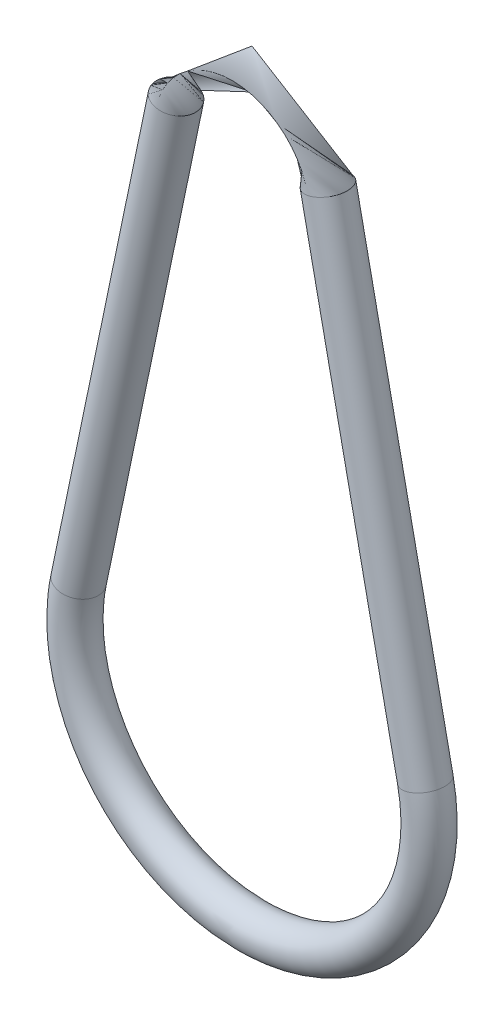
from build123d import *

# Parameters (mm, degrees)
SKETCH3_R          = 1
SKETCH4_R          = 0.001
CUT_EXTRUDE1_DEPTH = 70.5


with BuildPart() as part:
    # Sweep1: sweep along a path in Sketch1
    with BuildLine(Plane.XY) as sweep1_path:
        Line((-3.817920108, 25.295918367), (-8.712689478, 1.816326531))
        ThreePointArc((-8.712689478, 1.816326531), (0, -8.9), (8.712689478, 1.816326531))
        Line((8.712689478, 1.816326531), (3.817920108, 25.295918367))
        ThreePointArc((3.817920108, 25.295918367), (0, 28.4), (-3.817920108, 25.295918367))
    # Sketch3 → Sweep1 (sweep)
    with BuildSketch(Plane(origin=(0, 0, 0), x_dir=(1, 0, 0), z_dir=(0, 1, 0))):
        with Locations((-8.9, 0)):
            Circle(SKETCH3_R)
    sweep(path=sweep1_path.line)

    # Sketch4 → Cut-Extrude1 (cut, symmetric)
    with BuildSketch(Plane(origin=(0, 0, 0), x_dir=(1, 0, 0), z_dir=(0, 1, 0))):
        with Locations(Location((0, 0, 0), (0, 0, 161.558224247))):
            Circle(SKETCH4_R)
    extrude(amount=CUT_EXTRUDE1_DEPTH, both=True, mode=Mode.SUBTRACT)


solid = part.part
